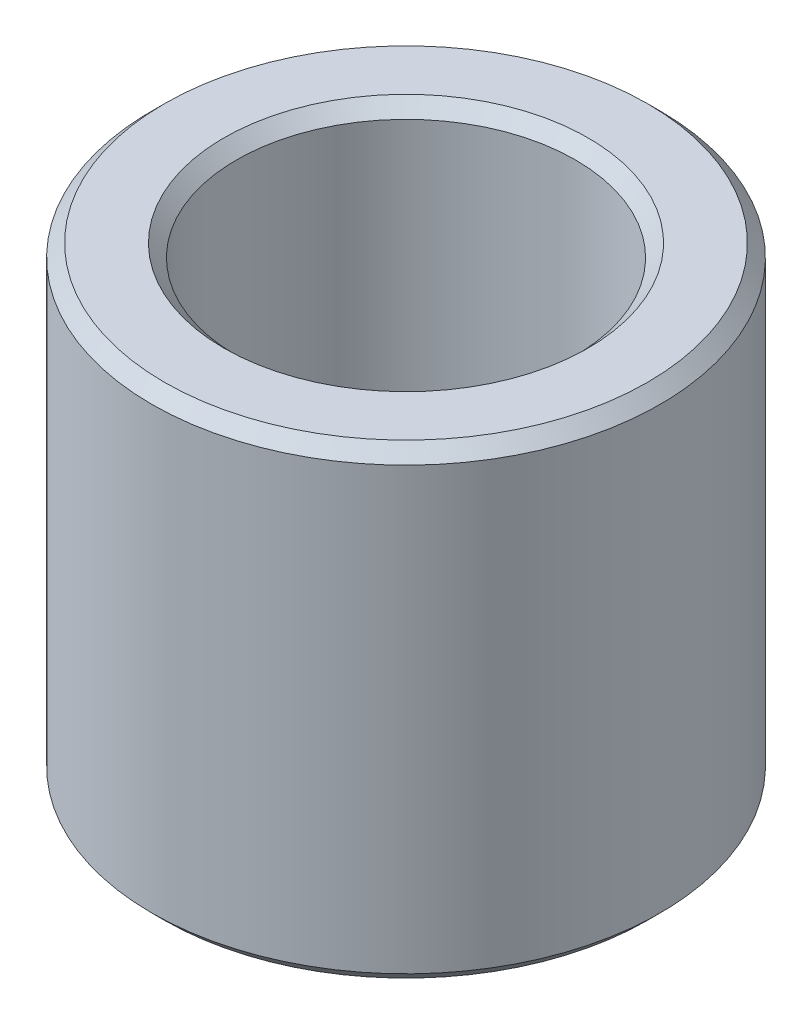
from build123d import *

# Parameters (mm, degrees)
ESQUISSE1_W     = 2
ESQUISSE1_H     = 11
CHANFREIN1_SIZE = 0.3


with BuildPart() as part:
    # Esquisse1 → Base-R_volution (revolve)
    with BuildSketch(Plane.XY, mode=Mode.PRIVATE) as base_r_volution_sk:
        with Locations((5, 5.5)):
            Rectangle(ESQUISSE1_W, ESQUISSE1_H)
    revolve(base_r_volution_sk.sketch.rotate(Axis((0, 30, 0), (0, -1, 0)), 90), axis=Axis((0, 30, 0), (0, -1, 0)))

    # Chanfrein1
    chanfrein1_edges = [part.edges().sort_by_distance(p)[0] for p in [
        (0, 11, -4),
        (0, 0, -4),
        (0, 0, -6),
        (0, 11, -6),
    ]]
    chamfer(chanfrein1_edges, length=CHANFREIN1_SIZE)


solid = part.part
